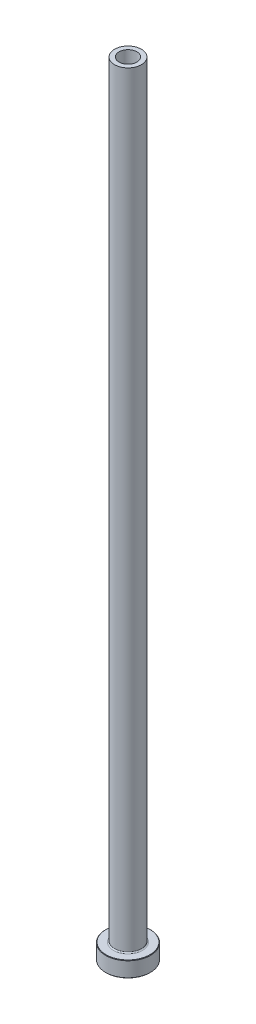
from build123d import *

# Parameters (mm, degrees)
FILLET1_R     = 0.5
CHAMFER1_SIZE = 0.2
CHAMFER3_SIZE = 0.5


with BuildPart() as part:
    # Sketch1 → Revolve1 (revolve)
    with BuildSketch(Plane.XY, mode=Mode.PRIVATE) as revolve1_sk:
        Polygon((-4, 350), (-6, 350), (-6, 7), (-10, 7), (-10, 0), (-4.25, 0), (-4.25, 293), (-4, 305), align=None)
    revolve(revolve1_sk.sketch.rotate(Axis((0, 92.187680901, 0), (0, -1, 0)), 270), axis=Axis((0, 92.187680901, 0), (0, -1, 0)))

    # Fillet1
    fillet1_edges = [part.edges().sort_by_distance(p)[0] for p in [
        (0, 7, -6),
    ]]
    fillet(fillet1_edges, radius=FILLET1_R)

    # Chamfer1
    chamfer1_edges = [part.edges().sort_by_distance(p)[0] for p in [
        (0, 0, -10),
        (0, 7, -10),
    ]]
    chamfer(chamfer1_edges, length=CHAMFER1_SIZE)

    # Chamfer3
    chamfer3_edges = [part.edges().sort_by_distance(p)[0] for p in [
        (0, 0, -4.25),
    ]]
    chamfer(chamfer3_edges, length=CHAMFER3_SIZE)


solid = part.part
